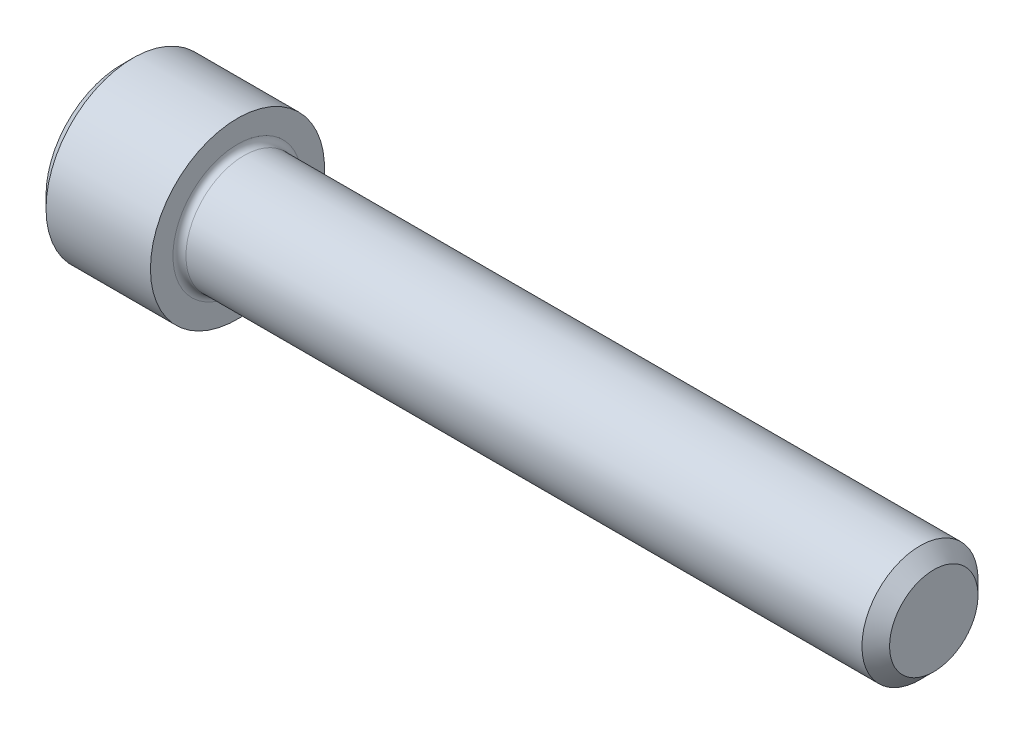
from build123d import *

# Parameters (mm, degrees)
FILLET1_R   = 0.3556
HEX_2_DEPTH = 3.048


with BuildPart() as part:
    # BodySke → Base-Revolve (revolve)
    with BuildSketch(Plane.XY, mode=Mode.PRIVATE) as base_revolve_sk:
        Polygon((0, 0), (0, 4.1275), (0.635, 4.7625), (6.35, 4.7625), (6.35, 3.175), (43.69435, 3.175), (44.45, 2.41935), (44.45, 0), align=None)
    revolve(base_revolve_sk.sketch.rotate(Axis((-31.75, 0, 0), (1, 0, 0)), 90), axis=Axis((-31.75, 0, 0), (1, 0, 0)))

    # Fillet1
    fillet1_edges = [part.edges().sort_by_distance(p)[0] for p in [
        (6.35, 0, -3.175),
    ]]
    fillet(fillet1_edges, radius=FILLET1_R)

    # Sketch2 → Hex-PreBroach (revolve, cut)
    with BuildSketch(Plane.XY, mode=Mode.PRIVATE) as hex_prebroach_sk:
        Polygon((0, 2.38125), (3.048, 2.38125), (4.422815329, 0), (0, 0), align=None)
    revolve(hex_prebroach_sk.sketch.rotate(Axis((0, 0, 0), (1, 0, 0)), 90), axis=Axis((0, 0, 0), (1, 0, 0)), mode=Mode.SUBTRACT)

    # Sketch3 → Hex 2 (cut)
    with BuildSketch(Plane(origin=(0, 0, 0), x_dir=(0, 0.500000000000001, 0.866025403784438), z_dir=(-1, 0, 0))):
        Polygon((1.374815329, 2.38125), (-1.374815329, 2.38125), (-2.749630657, 0), (-1.374815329, -2.38125), (1.374815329, -2.38125), (2.749630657, 0), align=None)
    extrude(amount=-HEX_2_DEPTH, mode=Mode.SUBTRACT)


solid = part.part
